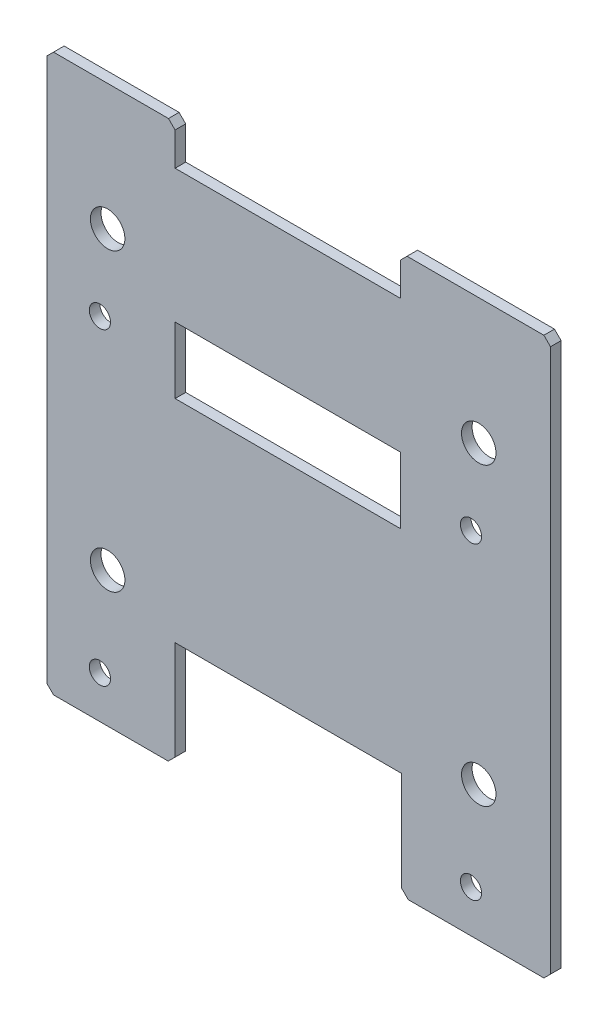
ISO-10303-21;
HEADER;
FILE_DESCRIPTION(('STEP AP214'),'2;1');
FILE_NAME('part.step','',(''),(''),'','','');
FILE_SCHEMA(('AUTOMOTIVE_DESIGN { 1 0 10303 214 1 1 1 1 }'));
ENDSEC;
DATA;
#1=APPLICATION_CONTEXT('core data for automotive mechanical design processes');
#2=APPLICATION_PROTOCOL_DEFINITION('international standard','automotive_design',2000,#1);
#3=PRODUCT_CONTEXT('',#1,'mechanical');
#4=PRODUCT('Part','Part','',(#3));
#5=PRODUCT_RELATED_PRODUCT_CATEGORY('part','',(#4));
#6=PRODUCT_DEFINITION_FORMATION('','',#4);
#7=PRODUCT_DEFINITION_CONTEXT('part definition',#1,'design');
#8=PRODUCT_DEFINITION('design','',#6,#7);
#9=PRODUCT_DEFINITION_SHAPE('','',#8);
#10=(LENGTH_UNIT() NAMED_UNIT(*) SI_UNIT(.MILLI.,.METRE.));
#11=(NAMED_UNIT(*) PLANE_ANGLE_UNIT() SI_UNIT($,.RADIAN.));
#12=(NAMED_UNIT(*) SI_UNIT($,.STERADIAN.) SOLID_ANGLE_UNIT());
#13=UNCERTAINTY_MEASURE_WITH_UNIT(LENGTH_MEASURE(1.E-05),#10,'distance_accuracy_value','');
#14=(GEOMETRIC_REPRESENTATION_CONTEXT(3) GLOBAL_UNCERTAINTY_ASSIGNED_CONTEXT((#13)) GLOBAL_UNIT_ASSIGNED_CONTEXT((#10,
#11,#12)) REPRESENTATION_CONTEXT('',''));
#15=CARTESIAN_POINT('',(0.,0.,0.));
#16=DIRECTION('',(0.,0.,1.));
#17=DIRECTION('',(1.,0.,0.));
#18=AXIS2_PLACEMENT_3D('',#15,#16,#17);
#19=CARTESIAN_POINT('',(776.743882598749,770.566370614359,-8.));
#20=DIRECTION('',(0.,1.,0.));
#21=DIRECTION('',(0.,0.,1.));
#22=AXIS2_PLACEMENT_3D('',#19,#20,#21);
#23=PLANE('',#22);
#24=DIRECTION('',(-1.,0.,0.));
#25=VECTOR('',#24,1.);
#26=CARTESIAN_POINT('',(776.743882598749,770.566370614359,-8.));
#27=LINE('',#26,#25);
#28=CARTESIAN_POINT('',(884.999999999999,770.566370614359,-8.));
#29=VERTEX_POINT('',#28);
#30=CARTESIAN_POINT('',(781.743882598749,770.566370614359,-8.));
#31=VERTEX_POINT('',#30);
#32=EDGE_CURVE('E279',#29,#31,#27,.T.);
#33=ORIENTED_EDGE('',*,*,#32,.T.);
#34=DIRECTION('',(0.,0.,1.));
#35=VECTOR('',#34,1.);
#36=CARTESIAN_POINT('',(781.743882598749,770.566370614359,-8.));
#37=LINE('',#36,#35);
#38=CARTESIAN_POINT('',(781.743882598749,770.566370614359,0.));
#39=VERTEX_POINT('',#38);
#40=EDGE_CURVE('E416',#31,#39,#37,.T.);
#41=ORIENTED_EDGE('',*,*,#40,.T.);
#42=DIRECTION('',(-1.,0.,0.));
#43=VECTOR('',#42,1.);
#44=CARTESIAN_POINT('',(776.743882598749,770.566370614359,0.));
#45=LINE('',#44,#43);
#46=CARTESIAN_POINT('',(884.999999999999,770.566370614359,0.));
#47=VERTEX_POINT('',#46);
#48=EDGE_CURVE('E278',#47,#39,#45,.T.);
#49=ORIENTED_EDGE('',*,*,#48,.F.);
#50=DIRECTION('',(0.,0.,-1.));
#51=VECTOR('',#50,1.);
#52=CARTESIAN_POINT('',(884.999999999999,770.566370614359,-8.));
#53=LINE('',#52,#51);
#54=EDGE_CURVE('E355',#47,#29,#53,.T.);
#55=ORIENTED_EDGE('',*,*,#54,.T.);
#56=EDGE_LOOP('',(#33,#41,#49,#55));
#57=FACE_BOUND('',#56,.T.);
#58=ADVANCED_FACE('F40',(#57),#23,.T.);
#59=CARTESIAN_POINT('',(889.999999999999,770.566370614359,-8.));
#60=DIRECTION('',(1.,0.,0.));
#61=DIRECTION('',(0.,1.,0.));
#62=AXIS2_PLACEMENT_3D('',#59,#60,#61);
#63=PLANE('',#62);
#64=DIRECTION('',(0.,1.,0.));
#65=VECTOR('',#64,1.);
#66=CARTESIAN_POINT('',(889.999999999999,770.566370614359,0.));
#67=LINE('',#66,#65);
#68=CARTESIAN_POINT('',(890.,355.566370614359,0.));
#69=VERTEX_POINT('',#68);
#70=CARTESIAN_POINT('',(889.999999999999,765.566370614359,0.));
#71=VERTEX_POINT('',#70);
#72=EDGE_CURVE('E283',#69,#71,#67,.T.);
#73=ORIENTED_EDGE('',*,*,#72,.F.);
#74=DIRECTION('',(0.,0.,-1.));
#75=VECTOR('',#74,1.);
#76=CARTESIAN_POINT('',(890.,355.566370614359,-8.));
#77=LINE('',#76,#75);
#78=CARTESIAN_POINT('',(890.,355.566370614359,-8.));
#79=VERTEX_POINT('',#78);
#80=EDGE_CURVE('E365',#69,#79,#77,.T.);
#81=ORIENTED_EDGE('',*,*,#80,.T.);
#82=DIRECTION('',(0.,1.,0.));
#83=VECTOR('',#82,1.);
#84=CARTESIAN_POINT('',(889.999999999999,770.566370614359,-8.));
#85=LINE('',#84,#83);
#86=CARTESIAN_POINT('',(889.999999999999,765.566370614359,-8.));
#87=VERTEX_POINT('',#86);
#88=EDGE_CURVE('E309',#79,#87,#85,.T.);
#89=ORIENTED_EDGE('',*,*,#88,.T.);
#90=DIRECTION('',(0.,0.,1.));
#91=VECTOR('',#90,1.);
#92=CARTESIAN_POINT('',(889.999999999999,765.566370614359,-8.));
#93=LINE('',#92,#91);
#94=EDGE_CURVE('E343',#87,#71,#93,.T.);
#95=ORIENTED_EDGE('',*,*,#94,.T.);
#96=EDGE_LOOP('',(#73,#81,#89,#95));
#97=FACE_BOUND('',#96,.T.);
#98=ADVANCED_FACE('F449',(#97),#63,.T.);
#99=CARTESIAN_POINT('',(890.,350.566370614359,-8.));
#100=DIRECTION('',(0.,-1.,0.));
#101=DIRECTION('',(0.,0.,-1.));
#102=AXIS2_PLACEMENT_3D('',#99,#100,#101);
#103=PLANE('',#102);
#104=DIRECTION('',(1.,0.,0.));
#105=VECTOR('',#104,1.);
#106=CARTESIAN_POINT('',(890.,350.566370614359,0.));
#107=LINE('',#106,#105);
#108=CARTESIAN_POINT('',(782.678837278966,350.566370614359,0.));
#109=VERTEX_POINT('',#108);
#110=CARTESIAN_POINT('',(885.,350.566370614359,0.));
#111=VERTEX_POINT('',#110);
#112=EDGE_CURVE('E338',#109,#111,#107,.T.);
#113=ORIENTED_EDGE('',*,*,#112,.F.);
#114=DIRECTION('',(0.,0.,-1.));
#115=VECTOR('',#114,1.);
#116=CARTESIAN_POINT('',(782.678837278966,350.566370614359,-8.));
#117=LINE('',#116,#115);
#118=CARTESIAN_POINT('',(782.678837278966,350.566370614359,-8.));
#119=VERTEX_POINT('',#118);
#120=EDGE_CURVE('E412',#109,#119,#117,.T.);
#121=ORIENTED_EDGE('',*,*,#120,.T.);
#122=DIRECTION('',(1.,0.,0.));
#123=VECTOR('',#122,1.);
#124=CARTESIAN_POINT('',(890.,350.566370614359,-8.));
#125=LINE('',#124,#123);
#126=CARTESIAN_POINT('',(885.,350.566370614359,-8.));
#127=VERTEX_POINT('',#126);
#128=EDGE_CURVE('E307',#119,#127,#125,.T.);
#129=ORIENTED_EDGE('',*,*,#128,.T.);
#130=DIRECTION('',(0.,0.,1.));
#131=VECTOR('',#130,1.);
#132=CARTESIAN_POINT('',(885.,350.566370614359,-8.));
#133=LINE('',#132,#131);
#134=EDGE_CURVE('E360',#127,#111,#133,.T.);
#135=ORIENTED_EDGE('',*,*,#134,.T.);
#136=EDGE_LOOP('',(#113,#121,#129,#135));
#137=FACE_BOUND('',#136,.T.);
#138=ADVANCED_FACE('F455',(#137),#103,.T.);
#139=CARTESIAN_POINT('',(777.678837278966,350.566370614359,-8.));
#140=DIRECTION('',(-1.,0.,0.));
#141=DIRECTION('',(0.,0.,1.));
#142=AXIS2_PLACEMENT_3D('',#139,#140,#141);
#143=PLANE('',#142);
#144=DIRECTION('',(0.,-1.,0.));
#145=VECTOR('',#144,1.);
#146=CARTESIAN_POINT('',(777.678837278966,350.566370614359,-8.));
#147=LINE('',#146,#145);
#148=CARTESIAN_POINT('',(777.678837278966,430.566370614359,-8.));
#149=VERTEX_POINT('',#148);
#150=CARTESIAN_POINT('',(777.678837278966,355.566370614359,-8.));
#151=VERTEX_POINT('',#150);
#152=EDGE_CURVE('E304',#149,#151,#147,.T.);
#153=ORIENTED_EDGE('',*,*,#152,.T.);
#154=DIRECTION('',(0.,0.,1.));
#155=VECTOR('',#154,1.);
#156=CARTESIAN_POINT('',(777.678837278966,355.566370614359,-8.));
#157=LINE('',#156,#155);
#158=CARTESIAN_POINT('',(777.678837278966,355.566370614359,0.));
#159=VERTEX_POINT('',#158);
#160=EDGE_CURVE('E407',#151,#159,#157,.T.);
#161=ORIENTED_EDGE('',*,*,#160,.T.);
#162=DIRECTION('',(0.,-1.,0.));
#163=VECTOR('',#162,1.);
#164=CARTESIAN_POINT('',(777.678837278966,350.566370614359,0.));
#165=LINE('',#164,#163);
#166=CARTESIAN_POINT('',(777.678837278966,430.566370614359,0.));
#167=VERTEX_POINT('',#166);
#168=EDGE_CURVE('E335',#167,#159,#165,.T.);
#169=ORIENTED_EDGE('',*,*,#168,.F.);
#170=DIRECTION('',(0.,0.,1.));
#171=VECTOR('',#170,1.);
#172=CARTESIAN_POINT('',(777.678837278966,430.566370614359,-8.));
#173=LINE('',#172,#171);
#174=EDGE_CURVE('E341',#149,#167,#173,.T.);
#175=ORIENTED_EDGE('',*,*,#174,.F.);
#176=EDGE_LOOP('',(#153,#161,#169,#175));
#177=FACE_BOUND('',#176,.T.);
#178=ADVANCED_FACE('F524',(#177),#143,.T.);
#179=CARTESIAN_POINT('',(777.678837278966,430.566370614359,-8.));
#180=DIRECTION('',(0.,-1.,0.));
#181=DIRECTION('',(0.,0.,-1.));
#182=AXIS2_PLACEMENT_3D('',#179,#180,#181);
#183=PLANE('',#182);
#184=DIRECTION('',(1.,0.,0.));
#185=VECTOR('',#184,1.);
#186=CARTESIAN_POINT('',(777.678837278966,430.566370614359,0.));
#187=LINE('',#186,#185);
#188=CARTESIAN_POINT('',(606.564585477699,430.566370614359,0.));
#189=VERTEX_POINT('',#188);
#190=EDGE_CURVE('E332',#189,#167,#187,.T.);
#191=ORIENTED_EDGE('',*,*,#190,.F.);
#192=DIRECTION('',(0.,0.,1.));
#193=VECTOR('',#192,1.);
#194=CARTESIAN_POINT('',(606.564585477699,430.566370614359,-8.));
#195=LINE('',#194,#193);
#196=CARTESIAN_POINT('',(606.564585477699,430.566370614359,-8.));
#197=VERTEX_POINT('',#196);
#198=EDGE_CURVE('E344',#197,#189,#195,.T.);
#199=ORIENTED_EDGE('',*,*,#198,.F.);
#200=DIRECTION('',(1.,0.,0.));
#201=VECTOR('',#200,1.);
#202=CARTESIAN_POINT('',(777.678837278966,430.566370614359,-8.));
#203=LINE('',#202,#201);
#204=EDGE_CURVE('E301',#197,#149,#203,.T.);
#205=ORIENTED_EDGE('',*,*,#204,.T.);
#206=ORIENTED_EDGE('',*,*,#174,.T.);
#207=EDGE_LOOP('',(#191,#199,#205,#206));
#208=FACE_BOUND('',#207,.T.);
#209=ADVANCED_FACE('F528',(#208),#183,.T.);
#210=CARTESIAN_POINT('',(606.564585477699,430.566370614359,-8.));
#211=DIRECTION('',(1.,0.,0.));
#212=DIRECTION('',(0.,0.,-1.));
#213=AXIS2_PLACEMENT_3D('',#210,#211,#212);
#214=PLANE('',#213);
#215=DIRECTION('',(0.,1.,0.));
#216=VECTOR('',#215,1.);
#217=CARTESIAN_POINT('',(606.564585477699,430.566370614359,0.));
#218=LINE('',#217,#216);
#219=CARTESIAN_POINT('',(606.564585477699,355.566370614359,0.));
#220=VERTEX_POINT('',#219);
#221=EDGE_CURVE('E330',#220,#189,#218,.T.);
#222=ORIENTED_EDGE('',*,*,#221,.F.);
#223=DIRECTION('',(0.,0.,-1.));
#224=VECTOR('',#223,1.);
#225=CARTESIAN_POINT('',(606.564585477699,355.566370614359,-8.));
#226=LINE('',#225,#224);
#227=CARTESIAN_POINT('',(606.564585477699,355.566370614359,-8.));
#228=VERTEX_POINT('',#227);
#229=EDGE_CURVE('E403',#220,#228,#226,.T.);
#230=ORIENTED_EDGE('',*,*,#229,.T.);
#231=DIRECTION('',(0.,1.,0.));
#232=VECTOR('',#231,1.);
#233=CARTESIAN_POINT('',(606.564585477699,430.566370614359,-8.));
#234=LINE('',#233,#232);
#235=EDGE_CURVE('E299',#228,#197,#234,.T.);
#236=ORIENTED_EDGE('',*,*,#235,.T.);
#237=ORIENTED_EDGE('',*,*,#198,.T.);
#238=EDGE_LOOP('',(#222,#230,#236,#237));
#239=FACE_BOUND('',#238,.T.);
#240=ADVANCED_FACE('F587',(#239),#214,.T.);
#241=CARTESIAN_POINT('',(606.564585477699,350.566370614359,-8.));
#242=DIRECTION('',(0.,-1.,0.));
#243=DIRECTION('',(0.,0.,-1.));
#244=AXIS2_PLACEMENT_3D('',#241,#242,#243);
#245=PLANE('',#244);
#246=DIRECTION('',(1.,0.,0.));
#247=VECTOR('',#246,1.);
#248=CARTESIAN_POINT('',(606.564585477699,350.566370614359,-8.));
#249=LINE('',#248,#247);
#250=CARTESIAN_POINT('',(515.,350.566370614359,-8.));
#251=VERTEX_POINT('',#250);
#252=CARTESIAN_POINT('',(601.564585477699,350.566370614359,-8.));
#253=VERTEX_POINT('',#252);
#254=EDGE_CURVE('E296',#251,#253,#249,.T.);
#255=ORIENTED_EDGE('',*,*,#254,.T.);
#256=DIRECTION('',(0.,0.,1.));
#257=VECTOR('',#256,1.);
#258=CARTESIAN_POINT('',(601.564585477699,350.566370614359,-8.));
#259=LINE('',#258,#257);
#260=CARTESIAN_POINT('',(601.564585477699,350.566370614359,0.));
#261=VERTEX_POINT('',#260);
#262=EDGE_CURVE('E398',#253,#261,#259,.T.);
#263=ORIENTED_EDGE('',*,*,#262,.T.);
#264=DIRECTION('',(1.,0.,0.));
#265=VECTOR('',#264,1.);
#266=CARTESIAN_POINT('',(606.564585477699,350.566370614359,0.));
#267=LINE('',#266,#265);
#268=CARTESIAN_POINT('',(515.,350.566370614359,0.));
#269=VERTEX_POINT('',#268);
#270=EDGE_CURVE('E327',#269,#261,#267,.T.);
#271=ORIENTED_EDGE('',*,*,#270,.F.);
#272=DIRECTION('',(0.,0.,-1.));
#273=VECTOR('',#272,1.);
#274=CARTESIAN_POINT('',(515.,350.566370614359,-8.));
#275=LINE('',#274,#273);
#276=EDGE_CURVE('E375',#269,#251,#275,.T.);
#277=ORIENTED_EDGE('',*,*,#276,.T.);
#278=EDGE_LOOP('',(#255,#263,#271,#277));
#279=FACE_BOUND('',#278,.T.);
#280=ADVANCED_FACE('F538',(#279),#245,.T.);
#281=CARTESIAN_POINT('',(510.,350.566370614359,-8.));
#282=DIRECTION('',(-1.,0.,0.));
#283=DIRECTION('',(0.,0.,1.));
#284=AXIS2_PLACEMENT_3D('',#281,#282,#283);
#285=PLANE('',#284);
#286=DIRECTION('',(0.,-1.,0.));
#287=VECTOR('',#286,1.);
#288=CARTESIAN_POINT('',(510.,350.566370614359,0.));
#289=LINE('',#288,#287);
#290=CARTESIAN_POINT('',(510.,765.566370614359,0.));
#291=VERTEX_POINT('',#290);
#292=CARTESIAN_POINT('',(510.,355.566370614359,0.));
#293=VERTEX_POINT('',#292);
#294=EDGE_CURVE('E325',#291,#293,#289,.T.);
#295=ORIENTED_EDGE('',*,*,#294,.F.);
#296=DIRECTION('',(0.,0.,-1.));
#297=VECTOR('',#296,1.);
#298=CARTESIAN_POINT('',(510.,765.566370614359,-8.));
#299=LINE('',#298,#297);
#300=CARTESIAN_POINT('',(510.,765.566370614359,-8.));
#301=VERTEX_POINT('',#300);
#302=EDGE_CURVE('E394',#291,#301,#299,.T.);
#303=ORIENTED_EDGE('',*,*,#302,.T.);
#304=DIRECTION('',(0.,-1.,0.));
#305=VECTOR('',#304,1.);
#306=CARTESIAN_POINT('',(510.,350.566370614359,-8.));
#307=LINE('',#306,#305);
#308=CARTESIAN_POINT('',(510.,355.566370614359,-8.));
#309=VERTEX_POINT('',#308);
#310=EDGE_CURVE('E294',#301,#309,#307,.T.);
#311=ORIENTED_EDGE('',*,*,#310,.T.);
#312=DIRECTION('',(0.,0.,1.));
#313=VECTOR('',#312,1.);
#314=CARTESIAN_POINT('',(510.,355.566370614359,-8.));
#315=LINE('',#314,#313);
#316=EDGE_CURVE('E370',#309,#293,#315,.T.);
#317=ORIENTED_EDGE('',*,*,#316,.T.);
#318=EDGE_LOOP('',(#295,#303,#311,#317));
#319=FACE_BOUND('',#318,.T.);
#320=ADVANCED_FACE('F547',(#319),#285,.T.);
#321=CARTESIAN_POINT('',(510.,770.566370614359,-8.));
#322=DIRECTION('',(0.,1.,0.));
#323=DIRECTION('',(0.,0.,1.));
#324=AXIS2_PLACEMENT_3D('',#321,#322,#323);
#325=PLANE('',#324);
#326=DIRECTION('',(-1.,0.,0.));
#327=VECTOR('',#326,1.);
#328=CARTESIAN_POINT('',(510.,770.566370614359,-8.));
#329=LINE('',#328,#327);
#330=CARTESIAN_POINT('',(601.743882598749,770.566370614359,-8.));
#331=VERTEX_POINT('',#330);
#332=CARTESIAN_POINT('',(515.,770.566370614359,-8.));
#333=VERTEX_POINT('',#332);
#334=EDGE_CURVE('E291',#331,#333,#329,.T.);
#335=ORIENTED_EDGE('',*,*,#334,.T.);
#336=DIRECTION('',(0.,0.,1.));
#337=VECTOR('',#336,1.);
#338=CARTESIAN_POINT('',(515.,770.566370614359,-8.));
#339=LINE('',#338,#337);
#340=CARTESIAN_POINT('',(515.,770.566370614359,0.));
#341=VERTEX_POINT('',#340);
#342=EDGE_CURVE('E389',#333,#341,#339,.T.);
#343=ORIENTED_EDGE('',*,*,#342,.T.);
#344=DIRECTION('',(-1.,0.,0.));
#345=VECTOR('',#344,1.);
#346=CARTESIAN_POINT('',(510.,770.566370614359,0.));
#347=LINE('',#346,#345);
#348=CARTESIAN_POINT('',(601.743882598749,770.566370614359,0.));
#349=VERTEX_POINT('',#348);
#350=EDGE_CURVE('E322',#349,#341,#347,.T.);
#351=ORIENTED_EDGE('',*,*,#350,.F.);
#352=DIRECTION('',(0.,0.,-1.));
#353=VECTOR('',#352,1.);
#354=CARTESIAN_POINT('',(601.743882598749,770.566370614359,-8.));
#355=LINE('',#354,#353);
#356=EDGE_CURVE('E385',#349,#331,#355,.T.);
#357=ORIENTED_EDGE('',*,*,#356,.T.);
#358=EDGE_LOOP('',(#335,#343,#351,#357));
#359=FACE_BOUND('',#358,.T.);
#360=ADVANCED_FACE('F555',(#359),#325,.T.);
#361=CARTESIAN_POINT('',(606.743882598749,770.566370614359,-8.));
#362=DIRECTION('',(1.,0.,0.));
#363=DIRECTION('',(0.,0.,-1.));
#364=AXIS2_PLACEMENT_3D('',#361,#362,#363);
#365=PLANE('',#364);
#366=DIRECTION('',(0.,1.,0.));
#367=VECTOR('',#366,1.);
#368=CARTESIAN_POINT('',(606.743882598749,770.566370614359,-8.));
#369=LINE('',#368,#367);
#370=CARTESIAN_POINT('',(606.743882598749,740.566370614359,-8.));
#371=VERTEX_POINT('',#370);
#372=CARTESIAN_POINT('',(606.743882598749,765.566370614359,-8.));
#373=VERTEX_POINT('',#372);
#374=EDGE_CURVE('E288',#371,#373,#369,.T.);
#375=ORIENTED_EDGE('',*,*,#374,.T.);
#376=DIRECTION('',(0.,0.,1.));
#377=VECTOR('',#376,1.);
#378=CARTESIAN_POINT('',(606.743882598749,765.566370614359,-8.));
#379=LINE('',#378,#377);
#380=CARTESIAN_POINT('',(606.743882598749,765.566370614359,0.));
#381=VERTEX_POINT('',#380);
#382=EDGE_CURVE('E380',#373,#381,#379,.T.);
#383=ORIENTED_EDGE('',*,*,#382,.T.);
#384=DIRECTION('',(0.,1.,0.));
#385=VECTOR('',#384,1.);
#386=CARTESIAN_POINT('',(606.743882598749,770.566370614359,0.));
#387=LINE('',#386,#385);
#388=CARTESIAN_POINT('',(606.743882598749,740.566370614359,0.));
#389=VERTEX_POINT('',#388);
#390=EDGE_CURVE('E319',#389,#381,#387,.T.);
#391=ORIENTED_EDGE('',*,*,#390,.F.);
#392=DIRECTION('',(0.,0.,1.));
#393=VECTOR('',#392,1.);
#394=CARTESIAN_POINT('',(606.743882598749,740.566370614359,-8.));
#395=LINE('',#394,#393);
#396=EDGE_CURVE('E347',#371,#389,#395,.T.);
#397=ORIENTED_EDGE('',*,*,#396,.F.);
#398=EDGE_LOOP('',(#375,#383,#391,#397));
#399=FACE_BOUND('',#398,.T.);
#400=ADVANCED_FACE('F561',(#399),#365,.T.);
#401=CARTESIAN_POINT('',(606.743882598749,740.566370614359,-8.));
#402=DIRECTION('',(0.,1.,0.));
#403=DIRECTION('',(-1.,0.,0.));
#404=AXIS2_PLACEMENT_3D('',#401,#402,#403);
#405=PLANE('',#404);
#406=DIRECTION('',(-1.,0.,0.));
#407=VECTOR('',#406,1.);
#408=CARTESIAN_POINT('',(606.743882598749,740.566370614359,0.));
#409=LINE('',#408,#407);
#410=CARTESIAN_POINT('',(776.743882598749,740.566370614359,0.));
#411=VERTEX_POINT('',#410);
#412=EDGE_CURVE('E316',#411,#389,#409,.T.);
#413=ORIENTED_EDGE('',*,*,#412,.F.);
#414=DIRECTION('',(0.,0.,1.));
#415=VECTOR('',#414,1.);
#416=CARTESIAN_POINT('',(776.743882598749,740.566370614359,-8.));
#417=LINE('',#416,#415);
#418=CARTESIAN_POINT('',(776.743882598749,740.566370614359,-8.));
#419=VERTEX_POINT('',#418);
#420=EDGE_CURVE('E311',#419,#411,#417,.T.);
#421=ORIENTED_EDGE('',*,*,#420,.F.);
#422=DIRECTION('',(-1.,0.,0.));
#423=VECTOR('',#422,1.);
#424=CARTESIAN_POINT('',(606.743882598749,740.566370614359,-8.));
#425=LINE('',#424,#423);
#426=EDGE_CURVE('E285',#419,#371,#425,.T.);
#427=ORIENTED_EDGE('',*,*,#426,.T.);
#428=ORIENTED_EDGE('',*,*,#396,.T.);
#429=EDGE_LOOP('',(#413,#421,#427,#428));
#430=FACE_BOUND('',#429,.T.);
#431=ADVANCED_FACE('F567',(#430),#405,.T.);
#432=CARTESIAN_POINT('',(776.743882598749,740.566370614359,-8.));
#433=DIRECTION('',(-1.,0.,0.));
#434=DIRECTION('',(0.,-1.,0.));
#435=AXIS2_PLACEMENT_3D('',#432,#433,#434);
#436=PLANE('',#435);
#437=DIRECTION('',(0.,-1.,0.));
#438=VECTOR('',#437,1.);
#439=CARTESIAN_POINT('',(776.743882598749,740.566370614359,0.));
#440=LINE('',#439,#438);
#441=CARTESIAN_POINT('',(776.743882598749,765.566370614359,0.));
#442=VERTEX_POINT('',#441);
#443=EDGE_CURVE('E314',#442,#411,#440,.T.);
#444=ORIENTED_EDGE('',*,*,#443,.F.);
#445=DIRECTION('',(0.,0.,-1.));
#446=VECTOR('',#445,1.);
#447=CARTESIAN_POINT('',(776.743882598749,765.566370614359,-8.));
#448=LINE('',#447,#446);
#449=CARTESIAN_POINT('',(776.743882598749,765.566370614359,-8.));
#450=VERTEX_POINT('',#449);
#451=EDGE_CURVE('E421',#442,#450,#448,.T.);
#452=ORIENTED_EDGE('',*,*,#451,.T.);
#453=DIRECTION('',(0.,-1.,0.));
#454=VECTOR('',#453,1.);
#455=CARTESIAN_POINT('',(776.743882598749,740.566370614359,-8.));
#456=LINE('',#455,#454);
#457=EDGE_CURVE('E282',#450,#419,#456,.T.);
#458=ORIENTED_EDGE('',*,*,#457,.T.);
#459=ORIENTED_EDGE('',*,*,#420,.T.);
#460=EDGE_LOOP('',(#444,#452,#458,#459));
#461=FACE_BOUND('',#460,.T.);
#462=ADVANCED_FACE('F460',(#461),#436,.T.);
#463=CARTESIAN_POINT('',(0.,0.,-8.));
#464=DIRECTION('',(0.,0.,-1.));
#465=DIRECTION('',(-1.,0.,0.));
#466=AXIS2_PLACEMENT_3D('',#463,#464,#465);
#467=PLANE('',#466);
#468=DIRECTION('',(-1.,0.,0.));
#469=VECTOR('',#468,1.);
#470=CARTESIAN_POINT('',(776.743882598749,590.079098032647,-8.));
#471=LINE('',#470,#469);
#472=CARTESIAN_POINT('',(776.743882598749,590.079098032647,-8.));
#473=VERTEX_POINT('',#472);
#474=CARTESIAN_POINT('',(606.743882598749,590.079098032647,-8.));
#475=VERTEX_POINT('',#474);
#476=EDGE_CURVE('E56',#473,#475,#471,.T.);
#477=ORIENTED_EDGE('',*,*,#476,.F.);
#478=DIRECTION('',(0.,-1.,0.));
#479=VECTOR('',#478,1.);
#480=CARTESIAN_POINT('',(776.743882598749,640.079098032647,-8.));
#481=LINE('',#480,#479);
#482=CARTESIAN_POINT('',(776.743882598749,640.079098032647,-8.));
#483=VERTEX_POINT('',#482);
#484=EDGE_CURVE('E221',#483,#473,#481,.T.);
#485=ORIENTED_EDGE('',*,*,#484,.F.);
#486=DIRECTION('',(1.,0.,0.));
#487=VECTOR('',#486,1.);
#488=CARTESIAN_POINT('',(606.743882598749,640.079098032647,-8.));
#489=LINE('',#488,#487);
#490=CARTESIAN_POINT('',(606.743882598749,640.079098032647,-8.));
#491=VERTEX_POINT('',#490);
#492=EDGE_CURVE('E205',#491,#483,#489,.T.);
#493=ORIENTED_EDGE('',*,*,#492,.F.);
#494=DIRECTION('',(0.,1.,0.));
#495=VECTOR('',#494,1.);
#496=CARTESIAN_POINT('',(606.743882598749,590.079098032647,-8.));
#497=LINE('',#496,#495);
#498=EDGE_CURVE('E214',#475,#491,#497,.T.);
#499=ORIENTED_EDGE('',*,*,#498,.F.);
#500=EDGE_LOOP('',(#477,#485,#493,#499));
#501=FACE_BOUND('',#500,.T.);
#502=CARTESIAN_POINT('',(829.999999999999,615.51272741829,-8.));
#503=DIRECTION('',(0.,0.,-1.));
#504=DIRECTION('',(-1.,0.,0.));
#505=AXIS2_PLACEMENT_3D('',#502,#503,#504);
#506=CIRCLE('',#505,7.99999999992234);
#507=CARTESIAN_POINT('',(822.000000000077,615.51272741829,-8.));
#508=VERTEX_POINT('',#507);
#509=EDGE_CURVE('E251',#508,#508,#506,.T.);
#510=ORIENTED_EDGE('',*,*,#509,.F.);
#511=EDGE_LOOP('',(#510));
#512=FACE_BOUND('',#511,.T.);
#513=CARTESIAN_POINT('',(550.,382.512727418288,-8.));
#514=DIRECTION('',(0.,0.,-1.));
#515=DIRECTION('',(-1.,0.,0.));
#516=AXIS2_PLACEMENT_3D('',#513,#514,#515);
#517=CIRCLE('',#516,7.99999999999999);
#518=CARTESIAN_POINT('',(542.,382.512727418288,-8.));
#519=VERTEX_POINT('',#518);
#520=EDGE_CURVE('E248',#519,#519,#517,.T.);
#521=ORIENTED_EDGE('',*,*,#520,.F.);
#522=EDGE_LOOP('',(#521));
#523=FACE_BOUND('',#522,.T.);
#524=CARTESIAN_POINT('',(829.999999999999,382.512727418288,-8.));
#525=DIRECTION('',(0.,0.,-1.));
#526=DIRECTION('',(-1.,0.,0.));
#527=AXIS2_PLACEMENT_3D('',#524,#525,#526);
#528=CIRCLE('',#527,7.99999999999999);
#529=CARTESIAN_POINT('',(821.999999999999,382.512727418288,-8.));
#530=VERTEX_POINT('',#529);
#531=EDGE_CURVE('E245',#530,#530,#528,.T.);
#532=ORIENTED_EDGE('',*,*,#531,.F.);
#533=EDGE_LOOP('',(#532));
#534=FACE_BOUND('',#533,.T.);
#535=CARTESIAN_POINT('',(550.,615.51272741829,-8.));
#536=DIRECTION('',(0.,0.,-1.));
#537=DIRECTION('',(-1.,0.,0.));
#538=AXIS2_PLACEMENT_3D('',#535,#536,#537);
#539=CIRCLE('',#538,7.99999999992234);
#540=CARTESIAN_POINT('',(542.000000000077,615.51272741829,-8.));
#541=VERTEX_POINT('',#540);
#542=EDGE_CURVE('E242',#541,#541,#539,.T.);
#543=ORIENTED_EDGE('',*,*,#542,.F.);
#544=EDGE_LOOP('',(#543));
#545=FACE_BOUND('',#544,.T.);
#546=CARTESIAN_POINT('',(835.843823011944,452.512727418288,-8.));
#547=DIRECTION('',(0.,0.,-1.));
#548=DIRECTION('',(-1.,0.,0.));
#549=AXIS2_PLACEMENT_3D('',#546,#547,#548);
#550=CIRCLE('',#549,13.);
#551=CARTESIAN_POINT('',(822.843823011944,452.512727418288,-8.));
#552=VERTEX_POINT('',#551);
#553=EDGE_CURVE('E275',#552,#552,#550,.T.);
#554=ORIENTED_EDGE('',*,*,#553,.F.);
#555=EDGE_LOOP('',(#554));
#556=FACE_BOUND('',#555,.T.);
#557=CARTESIAN_POINT('',(555.843823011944,675.51272741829,-8.));
#558=DIRECTION('',(0.,0.,-1.));
#559=DIRECTION('',(-1.,0.,0.));
#560=AXIS2_PLACEMENT_3D('',#557,#558,#559);
#561=CIRCLE('',#560,12.9999999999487);
#562=CARTESIAN_POINT('',(542.843823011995,675.51272741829,-8.));
#563=VERTEX_POINT('',#562);
#564=EDGE_CURVE('E272',#563,#563,#561,.T.);
#565=ORIENTED_EDGE('',*,*,#564,.F.);
#566=EDGE_LOOP('',(#565));
#567=FACE_BOUND('',#566,.T.);
#568=CARTESIAN_POINT('',(835.843823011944,675.51272741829,-8.));
#569=DIRECTION('',(0.,0.,-1.));
#570=DIRECTION('',(-1.,0.,0.));
#571=AXIS2_PLACEMENT_3D('',#568,#569,#570);
#572=CIRCLE('',#571,12.9999999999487);
#573=CARTESIAN_POINT('',(822.843823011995,675.51272741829,-8.));
#574=VERTEX_POINT('',#573);
#575=EDGE_CURVE('E269',#574,#574,#572,.T.);
#576=ORIENTED_EDGE('',*,*,#575,.F.);
#577=EDGE_LOOP('',(#576));
#578=FACE_BOUND('',#577,.T.);
#579=CARTESIAN_POINT('',(555.843823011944,452.512727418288,-8.));
#580=DIRECTION('',(0.,0.,-1.));
#581=DIRECTION('',(-1.,0.,0.));
#582=AXIS2_PLACEMENT_3D('',#579,#580,#581);
#583=CIRCLE('',#582,13.);
#584=CARTESIAN_POINT('',(542.843823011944,452.512727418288,-8.));
#585=VERTEX_POINT('',#584);
#586=EDGE_CURVE('E266',#585,#585,#583,.T.);
#587=ORIENTED_EDGE('',*,*,#586,.F.);
#588=EDGE_LOOP('',(#587));
#589=FACE_BOUND('',#588,.T.);
#590=ORIENTED_EDGE('',*,*,#457,.F.);
#591=DIRECTION('',(-0.707106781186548,-0.707106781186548,0.));
#592=VECTOR('',#591,1.);
#593=CARTESIAN_POINT('',(5.588755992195,-5.588755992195,-8.));
#594=LINE('',#593,#592);
#595=EDGE_CURVE('E423',#450,#31,#594,.F.);
#596=ORIENTED_EDGE('',*,*,#595,.T.);
#597=ORIENTED_EDGE('',*,*,#32,.F.);
#598=DIRECTION('',(-0.707106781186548,0.707106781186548,0.));
#599=VECTOR('',#598,1.);
#600=CARTESIAN_POINT('',(827.783185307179,827.783185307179,-8.));
#601=LINE('',#600,#599);
#602=EDGE_CURVE('E357',#29,#87,#601,.F.);
#603=ORIENTED_EDGE('',*,*,#602,.T.);
#604=ORIENTED_EDGE('',*,*,#88,.F.);
#605=DIRECTION('',(0.707106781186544,0.707106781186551,0.));
#606=VECTOR('',#605,1.);
#607=CARTESIAN_POINT('',(267.216814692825,-267.216814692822,-8.));
#608=LINE('',#607,#606);
#609=EDGE_CURVE('E367',#79,#127,#608,.F.);
#610=ORIENTED_EDGE('',*,*,#609,.T.);
#611=ORIENTED_EDGE('',*,*,#128,.F.);
#612=DIRECTION('',(0.707106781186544,-0.707106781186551,0.));
#613=VECTOR('',#612,1.);
#614=CARTESIAN_POINT('',(566.622603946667,566.622603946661,-8.));
#615=LINE('',#614,#613);
#616=EDGE_CURVE('E414',#119,#151,#615,.F.);
#617=ORIENTED_EDGE('',*,*,#616,.T.);
#618=ORIENTED_EDGE('',*,*,#152,.F.);
#619=ORIENTED_EDGE('',*,*,#204,.F.);
#620=ORIENTED_EDGE('',*,*,#235,.F.);
#621=DIRECTION('',(0.707106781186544,0.707106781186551,0.));
#622=VECTOR('',#621,1.);
#623=CARTESIAN_POINT('',(125.499107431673,-125.499107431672,-8.));
#624=LINE('',#623,#622);
#625=EDGE_CURVE('E405',#228,#253,#624,.F.);
#626=ORIENTED_EDGE('',*,*,#625,.T.);
#627=ORIENTED_EDGE('',*,*,#254,.F.);
#628=DIRECTION('',(0.707106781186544,-0.707106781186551,0.));
#629=VECTOR('',#628,1.);
#630=CARTESIAN_POINT('',(432.783185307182,432.783185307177,-8.));
#631=LINE('',#630,#629);
#632=EDGE_CURVE('E377',#251,#309,#631,.F.);
#633=ORIENTED_EDGE('',*,*,#632,.T.);
#634=ORIENTED_EDGE('',*,*,#310,.F.);
#635=DIRECTION('',(-0.707106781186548,-0.707106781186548,0.));
#636=VECTOR('',#635,1.);
#637=CARTESIAN_POINT('',(-127.78318530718,127.78318530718,-8.));
#638=LINE('',#637,#636);
#639=EDGE_CURVE('E396',#301,#333,#638,.F.);
#640=ORIENTED_EDGE('',*,*,#639,.T.);
#641=ORIENTED_EDGE('',*,*,#334,.F.);
#642=DIRECTION('',(-0.707106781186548,0.707106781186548,0.));
#643=VECTOR('',#642,1.);
#644=CARTESIAN_POINT('',(686.155126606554,686.155126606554,-8.));
#645=LINE('',#644,#643);
#646=EDGE_CURVE('E387',#331,#373,#645,.F.);
#647=ORIENTED_EDGE('',*,*,#646,.T.);
#648=ORIENTED_EDGE('',*,*,#374,.F.);
#649=ORIENTED_EDGE('',*,*,#426,.F.);
#650=EDGE_LOOP('',(#590,#596,#597,#603,#604,#610,#611,#617,#618,#619,#620,#626,#627,#633,#634,
#640,#641,#647,#648,#649));
#651=FACE_BOUND('',#650,.T.);
#652=ADVANCED_FACE('F218',(#501,#512,#523,#534,#545,#556,#567,#578,#589,#651),#467,.T.);
#653=CARTESIAN_POINT('',(0.,0.,0.));
#654=DIRECTION('',(0.,0.,-1.));
#655=DIRECTION('',(-1.,0.,0.));
#656=AXIS2_PLACEMENT_3D('',#653,#654,#655);
#657=PLANE('',#656);
#658=DIRECTION('',(0.,-1.,0.));
#659=VECTOR('',#658,1.);
#660=CARTESIAN_POINT('',(776.743882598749,0.,0.));
#661=LINE('',#660,#659);
#662=CARTESIAN_POINT('',(776.743882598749,640.079098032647,0.));
#663=VERTEX_POINT('',#662);
#664=CARTESIAN_POINT('',(776.743882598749,590.079098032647,0.));
#665=VERTEX_POINT('',#664);
#666=EDGE_CURVE('E49',#663,#665,#661,.T.);
#667=ORIENTED_EDGE('',*,*,#666,.T.);
#668=DIRECTION('',(-1.,0.,0.));
#669=VECTOR('',#668,1.);
#670=CARTESIAN_POINT('',(0.,590.079098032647,0.));
#671=LINE('',#670,#669);
#672=CARTESIAN_POINT('',(606.743882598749,590.079098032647,0.));
#673=VERTEX_POINT('',#672);
#674=EDGE_CURVE('E11',#665,#673,#671,.T.);
#675=ORIENTED_EDGE('',*,*,#674,.T.);
#676=DIRECTION('',(0.,1.,0.));
#677=VECTOR('',#676,1.);
#678=CARTESIAN_POINT('',(606.743882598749,0.,0.));
#679=LINE('',#678,#677);
#680=CARTESIAN_POINT('',(606.743882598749,640.079098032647,0.));
#681=VERTEX_POINT('',#680);
#682=EDGE_CURVE('E425',#673,#681,#679,.T.);
#683=ORIENTED_EDGE('',*,*,#682,.T.);
#684=DIRECTION('',(1.,0.,0.));
#685=VECTOR('',#684,1.);
#686=CARTESIAN_POINT('',(0.,640.079098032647,0.));
#687=LINE('',#686,#685);
#688=EDGE_CURVE('E208',#681,#663,#687,.T.);
#689=ORIENTED_EDGE('',*,*,#688,.T.);
#690=EDGE_LOOP('',(#667,#675,#683,#689));
#691=FACE_BOUND('',#690,.T.);
#692=CARTESIAN_POINT('',(829.999999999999,615.51272741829,0.));
#693=DIRECTION('',(0.,0.,1.));
#694=DIRECTION('',(1.,0.,0.));
#695=AXIS2_PLACEMENT_3D('',#692,#693,#694);
#696=CIRCLE('',#695,7.99999999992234);
#697=CARTESIAN_POINT('',(837.999999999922,615.51272741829,0.));
#698=VERTEX_POINT('',#697);
#699=EDGE_CURVE('E234',#698,#698,#696,.T.);
#700=ORIENTED_EDGE('',*,*,#699,.F.);
#701=EDGE_LOOP('',(#700));
#702=FACE_BOUND('',#701,.T.);
#703=CARTESIAN_POINT('',(550.,382.512727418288,0.));
#704=DIRECTION('',(0.,0.,1.));
#705=DIRECTION('',(1.,0.,0.));
#706=AXIS2_PLACEMENT_3D('',#703,#704,#705);
#707=CIRCLE('',#706,7.99999999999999);
#708=CARTESIAN_POINT('',(558.,382.512727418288,0.));
#709=VERTEX_POINT('',#708);
#710=EDGE_CURVE('E233',#709,#709,#707,.T.);
#711=ORIENTED_EDGE('',*,*,#710,.F.);
#712=EDGE_LOOP('',(#711));
#713=FACE_BOUND('',#712,.T.);
#714=CARTESIAN_POINT('',(829.999999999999,382.512727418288,0.));
#715=DIRECTION('',(0.,0.,1.));
#716=DIRECTION('',(1.,0.,0.));
#717=AXIS2_PLACEMENT_3D('',#714,#715,#716);
#718=CIRCLE('',#717,7.99999999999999);
#719=CARTESIAN_POINT('',(837.999999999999,382.512727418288,0.));
#720=VERTEX_POINT('',#719);
#721=EDGE_CURVE('E228',#720,#720,#718,.T.);
#722=ORIENTED_EDGE('',*,*,#721,.F.);
#723=EDGE_LOOP('',(#722));
#724=FACE_BOUND('',#723,.T.);
#725=CARTESIAN_POINT('',(550.,615.51272741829,0.));
#726=DIRECTION('',(0.,0.,1.));
#727=DIRECTION('',(1.,0.,0.));
#728=AXIS2_PLACEMENT_3D('',#725,#726,#727);
#729=CIRCLE('',#728,7.99999999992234);
#730=CARTESIAN_POINT('',(557.999999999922,615.51272741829,0.));
#731=VERTEX_POINT('',#730);
#732=EDGE_CURVE('E237',#731,#731,#729,.T.);
#733=ORIENTED_EDGE('',*,*,#732,.F.);
#734=EDGE_LOOP('',(#733));
#735=FACE_BOUND('',#734,.T.);
#736=CARTESIAN_POINT('',(835.843823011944,452.512727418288,0.));
#737=DIRECTION('',(0.,0.,1.));
#738=DIRECTION('',(1.,0.,0.));
#739=AXIS2_PLACEMENT_3D('',#736,#737,#738);
#740=CIRCLE('',#739,13.);
#741=CARTESIAN_POINT('',(848.843823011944,452.512727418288,0.));
#742=VERTEX_POINT('',#741);
#743=EDGE_CURVE('E258',#742,#742,#740,.T.);
#744=ORIENTED_EDGE('',*,*,#743,.F.);
#745=EDGE_LOOP('',(#744));
#746=FACE_BOUND('',#745,.T.);
#747=CARTESIAN_POINT('',(555.843823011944,675.51272741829,0.));
#748=DIRECTION('',(0.,0.,1.));
#749=DIRECTION('',(1.,0.,0.));
#750=AXIS2_PLACEMENT_3D('',#747,#748,#749);
#751=CIRCLE('',#750,12.9999999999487);
#752=CARTESIAN_POINT('',(568.843823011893,675.51272741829,0.));
#753=VERTEX_POINT('',#752);
#754=EDGE_CURVE('E257',#753,#753,#751,.T.);
#755=ORIENTED_EDGE('',*,*,#754,.F.);
#756=EDGE_LOOP('',(#755));
#757=FACE_BOUND('',#756,.T.);
#758=CARTESIAN_POINT('',(835.843823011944,675.51272741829,0.));
#759=DIRECTION('',(0.,0.,1.));
#760=DIRECTION('',(1.,0.,0.));
#761=AXIS2_PLACEMENT_3D('',#758,#759,#760);
#762=CIRCLE('',#761,12.9999999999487);
#763=CARTESIAN_POINT('',(848.843823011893,675.51272741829,0.));
#764=VERTEX_POINT('',#763);
#765=EDGE_CURVE('E254',#764,#764,#762,.T.);
#766=ORIENTED_EDGE('',*,*,#765,.F.);
#767=EDGE_LOOP('',(#766));
#768=FACE_BOUND('',#767,.T.);
#769=CARTESIAN_POINT('',(555.843823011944,452.512727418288,0.));
#770=DIRECTION('',(0.,0.,1.));
#771=DIRECTION('',(1.,0.,0.));
#772=AXIS2_PLACEMENT_3D('',#769,#770,#771);
#773=CIRCLE('',#772,13.);
#774=CARTESIAN_POINT('',(568.843823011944,452.512727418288,0.));
#775=VERTEX_POINT('',#774);
#776=EDGE_CURVE('E261',#775,#775,#773,.T.);
#777=ORIENTED_EDGE('',*,*,#776,.F.);
#778=EDGE_LOOP('',(#777));
#779=FACE_BOUND('',#778,.T.);
#780=ORIENTED_EDGE('',*,*,#48,.T.);
#781=DIRECTION('',(0.707106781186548,0.707106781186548,0.));
#782=VECTOR('',#781,1.);
#783=CARTESIAN_POINT('',(781.743882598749,770.566370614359,0.));
#784=LINE('',#783,#782);
#785=EDGE_CURVE('E419',#39,#442,#784,.F.);
#786=ORIENTED_EDGE('',*,*,#785,.T.);
#787=ORIENTED_EDGE('',*,*,#443,.T.);
#788=ORIENTED_EDGE('',*,*,#412,.T.);
#789=ORIENTED_EDGE('',*,*,#390,.T.);
#790=DIRECTION('',(0.707106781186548,-0.707106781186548,0.));
#791=VECTOR('',#790,1.);
#792=CARTESIAN_POINT('',(606.743882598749,765.566370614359,0.));
#793=LINE('',#792,#791);
#794=EDGE_CURVE('E383',#381,#349,#793,.F.);
#795=ORIENTED_EDGE('',*,*,#794,.T.);
#796=ORIENTED_EDGE('',*,*,#350,.T.);
#797=DIRECTION('',(0.707106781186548,0.707106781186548,0.));
#798=VECTOR('',#797,1.);
#799=CARTESIAN_POINT('',(515.,770.566370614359,0.));
#800=LINE('',#799,#798);
#801=EDGE_CURVE('E392',#341,#291,#800,.F.);
#802=ORIENTED_EDGE('',*,*,#801,.T.);
#803=ORIENTED_EDGE('',*,*,#294,.T.);
#804=DIRECTION('',(-0.707106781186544,0.707106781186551,0.));
#805=VECTOR('',#804,1.);
#806=CARTESIAN_POINT('',(510.,355.566370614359,0.));
#807=LINE('',#806,#805);
#808=EDGE_CURVE('E373',#293,#269,#807,.F.);
#809=ORIENTED_EDGE('',*,*,#808,.T.);
#810=ORIENTED_EDGE('',*,*,#270,.T.);
#811=DIRECTION('',(-0.707106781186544,-0.707106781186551,0.));
#812=VECTOR('',#811,1.);
#813=CARTESIAN_POINT('',(601.564585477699,350.566370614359,0.));
#814=LINE('',#813,#812);
#815=EDGE_CURVE('E401',#261,#220,#814,.F.);
#816=ORIENTED_EDGE('',*,*,#815,.T.);
#817=ORIENTED_EDGE('',*,*,#221,.T.);
#818=ORIENTED_EDGE('',*,*,#190,.T.);
#819=ORIENTED_EDGE('',*,*,#168,.T.);
#820=DIRECTION('',(-0.707106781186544,0.707106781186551,0.));
#821=VECTOR('',#820,1.);
#822=CARTESIAN_POINT('',(777.678837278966,355.566370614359,0.));
#823=LINE('',#822,#821);
#824=EDGE_CURVE('E410',#159,#109,#823,.F.);
#825=ORIENTED_EDGE('',*,*,#824,.T.);
#826=ORIENTED_EDGE('',*,*,#112,.T.);
#827=DIRECTION('',(-0.707106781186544,-0.707106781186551,0.));
#828=VECTOR('',#827,1.);
#829=CARTESIAN_POINT('',(885.,350.566370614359,0.));
#830=LINE('',#829,#828);
#831=EDGE_CURVE('E363',#111,#69,#830,.F.);
#832=ORIENTED_EDGE('',*,*,#831,.T.);
#833=ORIENTED_EDGE('',*,*,#72,.T.);
#834=DIRECTION('',(0.707106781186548,-0.707106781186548,0.));
#835=VECTOR('',#834,1.);
#836=CARTESIAN_POINT('',(889.999999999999,765.566370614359,0.));
#837=LINE('',#836,#835);
#838=EDGE_CURVE('E353',#71,#47,#837,.F.);
#839=ORIENTED_EDGE('',*,*,#838,.T.);
#840=EDGE_LOOP('',(#780,#786,#787,#788,#789,#795,#796,#802,#803,#809,#810,#816,#817,#818,#819,
#825,#826,#832,#833,#839));
#841=FACE_BOUND('',#840,.T.);
#842=ADVANCED_FACE('F429',(#691,#702,#713,#724,#735,#746,#757,#768,#779,#841),#657,.F.);
#843=CARTESIAN_POINT('',(555.843823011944,452.512727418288,-10.));
#844=DIRECTION('',(0.,0.,1.));
#845=DIRECTION('',(1.,0.,0.));
#846=AXIS2_PLACEMENT_3D('',#843,#844,#845);
#847=CYLINDRICAL_SURFACE('',#846,13.);
#848=ORIENTED_EDGE('',*,*,#586,.T.);
#849=EDGE_LOOP('',(#848));
#850=FACE_BOUND('',#849,.T.);
#851=ORIENTED_EDGE('',*,*,#776,.T.);
#852=EDGE_LOOP('',(#851));
#853=FACE_BOUND('',#852,.T.);
#854=ADVANCED_FACE('F615',(#850,#853),#847,.F.);
#855=CARTESIAN_POINT('',(835.843823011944,675.51272741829,-10.));
#856=DIRECTION('',(0.,0.,1.));
#857=DIRECTION('',(1.,0.,0.));
#858=AXIS2_PLACEMENT_3D('',#855,#856,#857);
#859=CYLINDRICAL_SURFACE('',#858,12.9999999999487);
#860=ORIENTED_EDGE('',*,*,#575,.T.);
#861=EDGE_LOOP('',(#860));
#862=FACE_BOUND('',#861,.T.);
#863=ORIENTED_EDGE('',*,*,#765,.T.);
#864=EDGE_LOOP('',(#863));
#865=FACE_BOUND('',#864,.T.);
#866=ADVANCED_FACE('F648',(#862,#865),#859,.F.);
#867=CARTESIAN_POINT('',(555.843823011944,675.51272741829,-10.));
#868=DIRECTION('',(0.,0.,1.));
#869=DIRECTION('',(1.,0.,0.));
#870=AXIS2_PLACEMENT_3D('',#867,#868,#869);
#871=CYLINDRICAL_SURFACE('',#870,12.9999999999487);
#872=ORIENTED_EDGE('',*,*,#564,.T.);
#873=EDGE_LOOP('',(#872));
#874=FACE_BOUND('',#873,.T.);
#875=ORIENTED_EDGE('',*,*,#754,.T.);
#876=EDGE_LOOP('',(#875));
#877=FACE_BOUND('',#876,.T.);
#878=ADVANCED_FACE('F660',(#874,#877),#871,.F.);
#879=CARTESIAN_POINT('',(835.843823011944,452.512727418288,-10.));
#880=DIRECTION('',(0.,0.,1.));
#881=DIRECTION('',(1.,0.,0.));
#882=AXIS2_PLACEMENT_3D('',#879,#880,#881);
#883=CYLINDRICAL_SURFACE('',#882,13.);
#884=ORIENTED_EDGE('',*,*,#553,.T.);
#885=EDGE_LOOP('',(#884));
#886=FACE_BOUND('',#885,.T.);
#887=ORIENTED_EDGE('',*,*,#743,.T.);
#888=EDGE_LOOP('',(#887));
#889=FACE_BOUND('',#888,.T.);
#890=ADVANCED_FACE('F470',(#886,#889),#883,.F.);
#891=CARTESIAN_POINT('',(889.999999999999,765.566370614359,-8.));
#892=DIRECTION('',(-0.707106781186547,-0.707106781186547,0.));
#893=DIRECTION('',(0.,0.,1.));
#894=AXIS2_PLACEMENT_3D('',#891,#892,#893);
#895=PLANE('',#894);
#896=ORIENTED_EDGE('',*,*,#602,.F.);
#897=ORIENTED_EDGE('',*,*,#54,.F.);
#898=ORIENTED_EDGE('',*,*,#838,.F.);
#899=ORIENTED_EDGE('',*,*,#94,.F.);
#900=EDGE_LOOP('',(#896,#897,#898,#899));
#901=FACE_BOUND('',#900,.T.);
#902=ADVANCED_FACE('F463',(#901),#895,.F.);
#903=CARTESIAN_POINT('',(885.,350.566370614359,-8.));
#904=DIRECTION('',(-0.707106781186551,0.707106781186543,0.));
#905=DIRECTION('',(0.,0.,1.));
#906=AXIS2_PLACEMENT_3D('',#903,#904,#905);
#907=PLANE('',#906);
#908=ORIENTED_EDGE('',*,*,#609,.F.);
#909=ORIENTED_EDGE('',*,*,#80,.F.);
#910=ORIENTED_EDGE('',*,*,#831,.F.);
#911=ORIENTED_EDGE('',*,*,#134,.F.);
#912=EDGE_LOOP('',(#908,#909,#910,#911));
#913=FACE_BOUND('',#912,.T.);
#914=ADVANCED_FACE('F469',(#913),#907,.F.);
#915=CARTESIAN_POINT('',(510.,355.566370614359,-8.));
#916=DIRECTION('',(0.707106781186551,0.707106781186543,0.));
#917=DIRECTION('',(0.,0.,1.));
#918=AXIS2_PLACEMENT_3D('',#915,#916,#917);
#919=PLANE('',#918);
#920=ORIENTED_EDGE('',*,*,#632,.F.);
#921=ORIENTED_EDGE('',*,*,#276,.F.);
#922=ORIENTED_EDGE('',*,*,#808,.F.);
#923=ORIENTED_EDGE('',*,*,#316,.F.);
#924=EDGE_LOOP('',(#920,#921,#922,#923));
#925=FACE_BOUND('',#924,.T.);
#926=ADVANCED_FACE('F477',(#925),#919,.F.);
#927=CARTESIAN_POINT('',(606.743882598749,765.566370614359,-8.));
#928=DIRECTION('',(-0.707106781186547,-0.707106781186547,0.));
#929=DIRECTION('',(0.,0.,1.));
#930=AXIS2_PLACEMENT_3D('',#927,#928,#929);
#931=PLANE('',#930);
#932=ORIENTED_EDGE('',*,*,#646,.F.);
#933=ORIENTED_EDGE('',*,*,#356,.F.);
#934=ORIENTED_EDGE('',*,*,#794,.F.);
#935=ORIENTED_EDGE('',*,*,#382,.F.);
#936=EDGE_LOOP('',(#932,#933,#934,#935));
#937=FACE_BOUND('',#936,.T.);
#938=ADVANCED_FACE('F484',(#937),#931,.F.);
#939=CARTESIAN_POINT('',(515.,770.566370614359,-8.));
#940=DIRECTION('',(0.707106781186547,-0.707106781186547,0.));
#941=DIRECTION('',(0.,0.,1.));
#942=AXIS2_PLACEMENT_3D('',#939,#940,#941);
#943=PLANE('',#942);
#944=ORIENTED_EDGE('',*,*,#639,.F.);
#945=ORIENTED_EDGE('',*,*,#302,.F.);
#946=ORIENTED_EDGE('',*,*,#801,.F.);
#947=ORIENTED_EDGE('',*,*,#342,.F.);
#948=EDGE_LOOP('',(#944,#945,#946,#947));
#949=FACE_BOUND('',#948,.T.);
#950=ADVANCED_FACE('F491',(#949),#943,.F.);
#951=CARTESIAN_POINT('',(601.564585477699,350.566370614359,-8.));
#952=DIRECTION('',(-0.707106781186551,0.707106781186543,0.));
#953=DIRECTION('',(0.,0.,1.));
#954=AXIS2_PLACEMENT_3D('',#951,#952,#953);
#955=PLANE('',#954);
#956=ORIENTED_EDGE('',*,*,#625,.F.);
#957=ORIENTED_EDGE('',*,*,#229,.F.);
#958=ORIENTED_EDGE('',*,*,#815,.F.);
#959=ORIENTED_EDGE('',*,*,#262,.F.);
#960=EDGE_LOOP('',(#956,#957,#958,#959));
#961=FACE_BOUND('',#960,.T.);
#962=ADVANCED_FACE('F498',(#961),#955,.F.);
#963=CARTESIAN_POINT('',(777.678837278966,355.566370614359,-8.));
#964=DIRECTION('',(0.707106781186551,0.707106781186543,0.));
#965=DIRECTION('',(0.,0.,1.));
#966=AXIS2_PLACEMENT_3D('',#963,#964,#965);
#967=PLANE('',#966);
#968=ORIENTED_EDGE('',*,*,#616,.F.);
#969=ORIENTED_EDGE('',*,*,#120,.F.);
#970=ORIENTED_EDGE('',*,*,#824,.F.);
#971=ORIENTED_EDGE('',*,*,#160,.F.);
#972=EDGE_LOOP('',(#968,#969,#970,#971));
#973=FACE_BOUND('',#972,.T.);
#974=ADVANCED_FACE('F504',(#973),#967,.F.);
#975=CARTESIAN_POINT('',(781.743882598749,770.566370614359,-8.));
#976=DIRECTION('',(0.707106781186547,-0.707106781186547,0.));
#977=DIRECTION('',(0.,0.,1.));
#978=AXIS2_PLACEMENT_3D('',#975,#976,#977);
#979=PLANE('',#978);
#980=ORIENTED_EDGE('',*,*,#595,.F.);
#981=ORIENTED_EDGE('',*,*,#451,.F.);
#982=ORIENTED_EDGE('',*,*,#785,.F.);
#983=ORIENTED_EDGE('',*,*,#40,.F.);
#984=EDGE_LOOP('',(#980,#981,#982,#983));
#985=FACE_BOUND('',#984,.T.);
#986=ADVANCED_FACE('F43',(#985),#979,.F.);
#987=CARTESIAN_POINT('',(550.,615.51272741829,-10.));
#988=DIRECTION('',(0.,0.,1.));
#989=DIRECTION('',(1.,0.,0.));
#990=AXIS2_PLACEMENT_3D('',#987,#988,#989);
#991=CYLINDRICAL_SURFACE('',#990,7.99999999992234);
#992=ORIENTED_EDGE('',*,*,#542,.T.);
#993=EDGE_LOOP('',(#992));
#994=FACE_BOUND('',#993,.T.);
#995=ORIENTED_EDGE('',*,*,#732,.T.);
#996=EDGE_LOOP('',(#995));
#997=FACE_BOUND('',#996,.T.);
#998=ADVANCED_FACE('F513',(#994,#997),#991,.F.);
#999=CARTESIAN_POINT('',(829.999999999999,382.512727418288,-10.));
#1000=DIRECTION('',(0.,0.,1.));
#1001=DIRECTION('',(1.,0.,0.));
#1002=AXIS2_PLACEMENT_3D('',#999,#1000,#1001);
#1003=CYLINDRICAL_SURFACE('',#1002,7.99999999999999);
#1004=ORIENTED_EDGE('',*,*,#531,.T.);
#1005=EDGE_LOOP('',(#1004));
#1006=FACE_BOUND('',#1005,.T.);
#1007=ORIENTED_EDGE('',*,*,#721,.T.);
#1008=EDGE_LOOP('',(#1007));
#1009=FACE_BOUND('',#1008,.T.);
#1010=ADVANCED_FACE('F805',(#1006,#1009),#1003,.F.);
#1011=CARTESIAN_POINT('',(550.,382.512727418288,-10.));
#1012=DIRECTION('',(0.,0.,1.));
#1013=DIRECTION('',(1.,0.,0.));
#1014=AXIS2_PLACEMENT_3D('',#1011,#1012,#1013);
#1015=CYLINDRICAL_SURFACE('',#1014,7.99999999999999);
#1016=ORIENTED_EDGE('',*,*,#520,.T.);
#1017=EDGE_LOOP('',(#1016));
#1018=FACE_BOUND('',#1017,.T.);
#1019=ORIENTED_EDGE('',*,*,#710,.T.);
#1020=EDGE_LOOP('',(#1019));
#1021=FACE_BOUND('',#1020,.T.);
#1022=ADVANCED_FACE('F443',(#1018,#1021),#1015,.F.);
#1023=CARTESIAN_POINT('',(829.999999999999,615.51272741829,-10.));
#1024=DIRECTION('',(0.,0.,1.));
#1025=DIRECTION('',(1.,0.,0.));
#1026=AXIS2_PLACEMENT_3D('',#1023,#1024,#1025);
#1027=CYLINDRICAL_SURFACE('',#1026,7.99999999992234);
#1028=ORIENTED_EDGE('',*,*,#509,.T.);
#1029=EDGE_LOOP('',(#1028));
#1030=FACE_BOUND('',#1029,.T.);
#1031=ORIENTED_EDGE('',*,*,#699,.T.);
#1032=EDGE_LOOP('',(#1031));
#1033=FACE_BOUND('',#1032,.T.);
#1034=ADVANCED_FACE('F436',(#1030,#1033),#1027,.F.);
#1035=CARTESIAN_POINT('',(776.743882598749,590.079098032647,2.));
#1036=DIRECTION('',(0.,-1.,0.));
#1037=DIRECTION('',(0.,0.,-1.));
#1038=AXIS2_PLACEMENT_3D('',#1035,#1036,#1037);
#1039=PLANE('',#1038);
#1040=DIRECTION('',(0.,0.,-1.));
#1041=VECTOR('',#1040,1.);
#1042=CARTESIAN_POINT('',(776.743882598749,590.079098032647,2.));
#1043=LINE('',#1042,#1041);
#1044=EDGE_CURVE('E226',#665,#473,#1043,.T.);
#1045=ORIENTED_EDGE('',*,*,#1044,.T.);
#1046=ORIENTED_EDGE('',*,*,#476,.T.);
#1047=DIRECTION('',(0.,0.,-1.));
#1048=VECTOR('',#1047,1.);
#1049=CARTESIAN_POINT('',(606.743882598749,590.079098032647,2.));
#1050=LINE('',#1049,#1048);
#1051=EDGE_CURVE('E211',#673,#475,#1050,.T.);
#1052=ORIENTED_EDGE('',*,*,#1051,.F.);
#1053=ORIENTED_EDGE('',*,*,#674,.F.);
#1054=EDGE_LOOP('',(#1045,#1046,#1052,#1053));
#1055=FACE_BOUND('',#1054,.T.);
#1056=ADVANCED_FACE('F434',(#1055),#1039,.F.);
#1057=CARTESIAN_POINT('',(776.743882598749,640.079098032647,2.));
#1058=DIRECTION('',(1.,0.,0.));
#1059=DIRECTION('',(0.,0.,-1.));
#1060=AXIS2_PLACEMENT_3D('',#1057,#1058,#1059);
#1061=PLANE('',#1060);
#1062=DIRECTION('',(0.,0.,-1.));
#1063=VECTOR('',#1062,1.);
#1064=CARTESIAN_POINT('',(776.743882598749,640.079098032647,2.));
#1065=LINE('',#1064,#1063);
#1066=EDGE_CURVE('E210',#663,#483,#1065,.T.);
#1067=ORIENTED_EDGE('',*,*,#1066,.T.);
#1068=ORIENTED_EDGE('',*,*,#484,.T.);
#1069=ORIENTED_EDGE('',*,*,#1044,.F.);
#1070=ORIENTED_EDGE('',*,*,#666,.F.);
#1071=EDGE_LOOP('',(#1067,#1068,#1069,#1070));
#1072=FACE_BOUND('',#1071,.T.);
#1073=ADVANCED_FACE('F433',(#1072),#1061,.F.);
#1074=CARTESIAN_POINT('',(606.743882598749,640.079098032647,2.));
#1075=DIRECTION('',(0.,1.,0.));
#1076=DIRECTION('',(0.,0.,1.));
#1077=AXIS2_PLACEMENT_3D('',#1074,#1075,#1076);
#1078=PLANE('',#1077);
#1079=DIRECTION('',(0.,0.,-1.));
#1080=VECTOR('',#1079,1.);
#1081=CARTESIAN_POINT('',(606.743882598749,640.079098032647,2.));
#1082=LINE('',#1081,#1080);
#1083=EDGE_CURVE('E64',#681,#491,#1082,.T.);
#1084=ORIENTED_EDGE('',*,*,#1083,.T.);
#1085=ORIENTED_EDGE('',*,*,#492,.T.);
#1086=ORIENTED_EDGE('',*,*,#1066,.F.);
#1087=ORIENTED_EDGE('',*,*,#688,.F.);
#1088=EDGE_LOOP('',(#1084,#1085,#1086,#1087));
#1089=FACE_BOUND('',#1088,.T.);
#1090=ADVANCED_FACE('F202',(#1089),#1078,.F.);
#1091=CARTESIAN_POINT('',(606.743882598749,590.079098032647,2.));
#1092=DIRECTION('',(-1.,0.,0.));
#1093=DIRECTION('',(0.,0.,1.));
#1094=AXIS2_PLACEMENT_3D('',#1091,#1092,#1093);
#1095=PLANE('',#1094);
#1096=ORIENTED_EDGE('',*,*,#1051,.T.);
#1097=ORIENTED_EDGE('',*,*,#498,.T.);
#1098=ORIENTED_EDGE('',*,*,#1083,.F.);
#1099=ORIENTED_EDGE('',*,*,#682,.F.);
#1100=EDGE_LOOP('',(#1096,#1097,#1098,#1099));
#1101=FACE_BOUND('',#1100,.T.);
#1102=ADVANCED_FACE('F215',(#1101),#1095,.F.);
#1103=CLOSED_SHELL('',(#58,#98,#138,#178,#209,#240,#280,#320,#360,#400,#431,#462,#652,#842,#854,
#866,#878,#890,#902,#914,#926,#938,#950,#962,#974,#986,#998,#1010,#1022,#1034,#1056,#1073,#1090,#1102));
#1104=MANIFOLD_SOLID_BREP('B2',#1103);
#1105=ADVANCED_BREP_SHAPE_REPRESENTATION('',(#18,#1104),#14);
#1106=SHAPE_DEFINITION_REPRESENTATION(#9,#1105);
ENDSEC;
END-ISO-10303-21;
